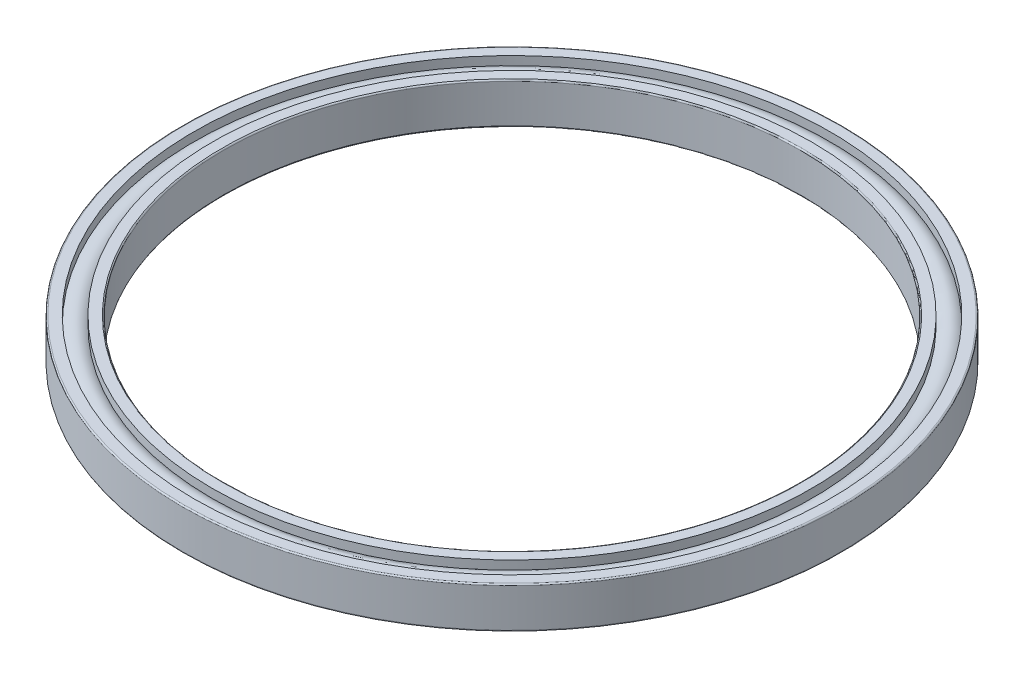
ISO-10303-21;
HEADER;
FILE_DESCRIPTION(('STEP AP214'),'2;1');
FILE_NAME('part.step','',(''),(''),'','','');
FILE_SCHEMA(('AUTOMOTIVE_DESIGN { 1 0 10303 214 1 1 1 1 }'));
ENDSEC;
DATA;
#1=APPLICATION_CONTEXT('core data for automotive mechanical design processes');
#2=APPLICATION_PROTOCOL_DEFINITION('international standard','automotive_design',2000,#1);
#3=PRODUCT_CONTEXT('',#1,'mechanical');
#4=PRODUCT('Part','Part','',(#3));
#5=PRODUCT_RELATED_PRODUCT_CATEGORY('part','',(#4));
#6=PRODUCT_DEFINITION_FORMATION('','',#4);
#7=PRODUCT_DEFINITION_CONTEXT('part definition',#1,'design');
#8=PRODUCT_DEFINITION('design','',#6,#7);
#9=PRODUCT_DEFINITION_SHAPE('','',#8);
#10=(LENGTH_UNIT() NAMED_UNIT(*) SI_UNIT(.MILLI.,.METRE.));
#11=(NAMED_UNIT(*) PLANE_ANGLE_UNIT() SI_UNIT($,.RADIAN.));
#12=(NAMED_UNIT(*) SI_UNIT($,.STERADIAN.) SOLID_ANGLE_UNIT());
#13=UNCERTAINTY_MEASURE_WITH_UNIT(LENGTH_MEASURE(1.E-05),#10,'distance_accuracy_value','');
#14=(GEOMETRIC_REPRESENTATION_CONTEXT(3) GLOBAL_UNCERTAINTY_ASSIGNED_CONTEXT((#13)) GLOBAL_UNIT_ASSIGNED_CONTEXT((#10,
#11,#12)) REPRESENTATION_CONTEXT('',''));
#15=CARTESIAN_POINT('',(0.,0.,0.));
#16=DIRECTION('',(0.,0.,1.));
#17=DIRECTION('',(1.,0.,0.));
#18=AXIS2_PLACEMENT_3D('',#15,#16,#17);
#19=CARTESIAN_POINT('',(0.,-4.0675,0.));
#20=DIRECTION('',(0.,1.,0.));
#21=DIRECTION('',(0.,0.,1.));
#22=AXIS2_PLACEMENT_3D('',#19,#20,#21);
#23=CYLINDRICAL_SURFACE('',#22,44.45);
#24=CARTESIAN_POINT('',(0.,2.4,0.));
#25=DIRECTION('',(0.,1.,0.));
#26=DIRECTION('',(0.,0.,-1.));
#27=AXIS2_PLACEMENT_3D('',#24,#25,#26);
#28=CIRCLE('',#27,44.45);
#29=CARTESIAN_POINT('',(0.,2.4,-44.45));
#30=VERTEX_POINT('',#29);
#31=EDGE_CURVE('E60',#30,#30,#28,.F.);
#32=ORIENTED_EDGE('',*,*,#31,.F.);
#33=EDGE_LOOP('',(#32));
#34=FACE_BOUND('',#33,.T.);
#35=CARTESIAN_POINT('',(0.,-3.55,0.));
#36=DIRECTION('',(0.,1.,0.));
#37=DIRECTION('',(0.,0.,-1.));
#38=AXIS2_PLACEMENT_3D('',#35,#36,#37);
#39=CIRCLE('',#38,44.45);
#40=CARTESIAN_POINT('',(0.,-3.55,-44.45));
#41=VERTEX_POINT('',#40);
#42=EDGE_CURVE('E283',#41,#41,#39,.T.);
#43=ORIENTED_EDGE('',*,*,#42,.F.);
#44=EDGE_LOOP('',(#43));
#45=FACE_BOUND('',#44,.T.);
#46=ADVANCED_FACE('F16',(#34,#45),#23,.F.);
#47=CARTESIAN_POINT('',(0.,-3.55,0.));
#48=DIRECTION('',(0.,1.,0.));
#49=DIRECTION('',(0.,0.,-1.));
#50=AXIS2_PLACEMENT_3D('',#47,#48,#49);
#51=TOROIDAL_SURFACE('',#50,44.65,0.2);
#52=CARTESIAN_POINT('',(0.,-3.75,0.));
#53=DIRECTION('',(0.,-1.,0.));
#54=DIRECTION('',(0.,0.,-1.));
#55=AXIS2_PLACEMENT_3D('',#52,#53,#54);
#56=CIRCLE('',#55,44.65);
#57=CARTESIAN_POINT('',(0.,-3.75,-44.65));
#58=VERTEX_POINT('',#57);
#59=CARTESIAN_POINT('',(0.,-3.75,44.65));
#60=VERTEX_POINT('',#59);
#61=EDGE_CURVE('E55',#58,#60,#56,.T.);
#62=ORIENTED_EDGE('',*,*,#61,.T.);
#63=CARTESIAN_POINT('',(0.,-3.75,0.));
#64=DIRECTION('',(0.,-1.,0.));
#65=DIRECTION('',(0.,0.,1.));
#66=AXIS2_PLACEMENT_3D('',#63,#64,#65);
#67=CIRCLE('',#66,44.65);
#68=EDGE_CURVE('E52',#60,#58,#67,.T.);
#69=ORIENTED_EDGE('',*,*,#68,.T.);
#70=EDGE_LOOP('',(#62,#69));
#71=FACE_BOUND('',#70,.T.);
#72=ORIENTED_EDGE('',*,*,#42,.T.);
#73=EDGE_LOOP('',(#72));
#74=FACE_BOUND('',#73,.T.);
#75=ADVANCED_FACE('F56',(#71,#74),#51,.T.);
#76=CARTESIAN_POINT('',(0.,2.4,0.));
#77=DIRECTION('',(0.,1.,0.));
#78=DIRECTION('',(0.,0.,-1.));
#79=AXIS2_PLACEMENT_3D('',#76,#77,#78);
#80=TOROIDAL_SURFACE('',#79,44.65,0.2);
#81=ORIENTED_EDGE('',*,*,#31,.T.);
#82=EDGE_LOOP('',(#81));
#83=FACE_BOUND('',#82,.T.);
#84=CARTESIAN_POINT('',(0.,2.6,0.));
#85=DIRECTION('',(0.,1.,0.));
#86=DIRECTION('',(0.,0.,-1.));
#87=AXIS2_PLACEMENT_3D('',#84,#85,#86);
#88=CIRCLE('',#87,44.65);
#89=CARTESIAN_POINT('',(0.,2.6,44.65));
#90=VERTEX_POINT('',#89);
#91=CARTESIAN_POINT('',(0.,2.6,-44.65));
#92=VERTEX_POINT('',#91);
#93=EDGE_CURVE('E249',#90,#92,#88,.F.);
#94=ORIENTED_EDGE('',*,*,#93,.F.);
#95=CARTESIAN_POINT('',(0.,2.6,0.));
#96=DIRECTION('',(0.,1.,0.));
#97=DIRECTION('',(0.,0.,1.));
#98=AXIS2_PLACEMENT_3D('',#95,#96,#97);
#99=CIRCLE('',#98,44.65);
#100=EDGE_CURVE('E65',#92,#90,#99,.F.);
#101=ORIENTED_EDGE('',*,*,#100,.F.);
#102=EDGE_LOOP('',(#94,#101));
#103=FACE_BOUND('',#102,.T.);
#104=ADVANCED_FACE('F86',(#83,#103),#80,.T.);
#105=CARTESIAN_POINT('',(0.,-3.75,0.));
#106=DIRECTION('',(0.,1.,0.));
#107=DIRECTION('',(0.,0.,1.));
#108=AXIS2_PLACEMENT_3D('',#105,#106,#107);
#109=PLANE('',#108);
#110=ORIENTED_EDGE('',*,*,#61,.F.);
#111=ORIENTED_EDGE('',*,*,#68,.F.);
#112=EDGE_LOOP('',(#110,#111));
#113=FACE_BOUND('',#112,.T.);
#114=CARTESIAN_POINT('',(0.,-3.75,0.));
#115=DIRECTION('',(0.,1.,0.));
#116=DIRECTION('',(0.,0.,1.));
#117=AXIS2_PLACEMENT_3D('',#114,#115,#116);
#118=CIRCLE('',#117,46.225);
#119=CARTESIAN_POINT('',(0.,-3.75,46.225));
#120=VERTEX_POINT('',#119);
#121=EDGE_CURVE('E258',#120,#120,#118,.T.);
#122=ORIENTED_EDGE('',*,*,#121,.F.);
#123=EDGE_LOOP('',(#122));
#124=FACE_BOUND('',#123,.T.);
#125=ADVANCED_FACE('F63',(#113,#124),#109,.F.);
#126=CARTESIAN_POINT('',(0.,2.6,0.));
#127=DIRECTION('',(0.,1.,0.));
#128=DIRECTION('',(0.,0.,1.));
#129=AXIS2_PLACEMENT_3D('',#126,#127,#128);
#130=PLANE('',#129);
#131=ORIENTED_EDGE('',*,*,#100,.T.);
#132=ORIENTED_EDGE('',*,*,#93,.T.);
#133=EDGE_LOOP('',(#131,#132));
#134=FACE_BOUND('',#133,.T.);
#135=CARTESIAN_POINT('',(0.,2.6,0.));
#136=DIRECTION('',(0.,1.,0.));
#137=DIRECTION('',(0.,0.,1.));
#138=AXIS2_PLACEMENT_3D('',#135,#136,#137);
#139=CIRCLE('',#138,46.225);
#140=CARTESIAN_POINT('',(0.,2.6,46.225));
#141=VERTEX_POINT('',#140);
#142=EDGE_CURVE('E237',#141,#141,#139,.F.);
#143=ORIENTED_EDGE('',*,*,#142,.F.);
#144=EDGE_LOOP('',(#143));
#145=FACE_BOUND('',#144,.T.);
#146=ADVANCED_FACE('F85',(#134,#145),#130,.T.);
#147=CARTESIAN_POINT('',(0.,-4.0675,0.));
#148=DIRECTION('',(0.,1.,0.));
#149=DIRECTION('',(0.,0.,1.));
#150=AXIS2_PLACEMENT_3D('',#147,#148,#149);
#151=CYLINDRICAL_SURFACE('',#150,46.225);
#152=ORIENTED_EDGE('',*,*,#121,.T.);
#153=EDGE_LOOP('',(#152));
#154=FACE_BOUND('',#153,.T.);
#155=CARTESIAN_POINT('',(0.,-2.39982875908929,0.));
#156=DIRECTION('',(0.,1.,0.));
#157=DIRECTION('',(0.,0.,-1.));
#158=AXIS2_PLACEMENT_3D('',#155,#156,#157);
#159=CIRCLE('',#158,46.2249999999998);
#160=CARTESIAN_POINT('',(0.,-2.39982875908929,-46.2249999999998));
#161=VERTEX_POINT('',#160);
#162=EDGE_CURVE('E234',#161,#161,#159,.T.);
#163=ORIENTED_EDGE('',*,*,#162,.F.);
#164=EDGE_LOOP('',(#163));
#165=FACE_BOUND('',#164,.T.);
#166=ADVANCED_FACE('F357',(#154,#165),#151,.T.);
#167=CARTESIAN_POINT('',(0.,-4.0675,0.));
#168=DIRECTION('',(0.,1.,0.));
#169=DIRECTION('',(0.,0.,1.));
#170=AXIS2_PLACEMENT_3D('',#167,#168,#169);
#171=CYLINDRICAL_SURFACE('',#170,46.225);
#172=CARTESIAN_POINT('',(0.,1.24982875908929,0.));
#173=DIRECTION('',(0.,1.,0.));
#174=DIRECTION('',(0.,0.,-1.));
#175=AXIS2_PLACEMENT_3D('',#172,#173,#174);
#176=CIRCLE('',#175,46.2249999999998);
#177=CARTESIAN_POINT('',(0.,1.24982875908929,-46.2249999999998));
#178=VERTEX_POINT('',#177);
#179=EDGE_CURVE('E231',#178,#178,#176,.F.);
#180=ORIENTED_EDGE('',*,*,#179,.F.);
#181=EDGE_LOOP('',(#180));
#182=FACE_BOUND('',#181,.T.);
#183=ORIENTED_EDGE('',*,*,#142,.T.);
#184=EDGE_LOOP('',(#183));
#185=FACE_BOUND('',#184,.T.);
#186=ADVANCED_FACE('F226',(#182,#185),#171,.T.);
#187=CARTESIAN_POINT('',(0.,-0.575,0.));
#188=DIRECTION('',(0.,1.,0.));
#189=DIRECTION('',(0.,0.,-1.));
#190=AXIS2_PLACEMENT_3D('',#187,#188,#189);
#191=TOROIDAL_SURFACE('',#190,47.625,2.3);
#192=ORIENTED_EDGE('',*,*,#162,.T.);
#193=EDGE_LOOP('',(#192));
#194=FACE_BOUND('',#193,.T.);
#195=CARTESIAN_POINT('',(0.,-2.399828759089,0.));
#196=DIRECTION('',(0.,1.,0.));
#197=DIRECTION('',(0.,0.,1.));
#198=AXIS2_PLACEMENT_3D('',#195,#196,#197);
#199=CIRCLE('',#198,49.025);
#200=CARTESIAN_POINT('',(0.,-2.399828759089,49.025));
#201=VERTEX_POINT('',#200);
#202=EDGE_CURVE('E230',#201,#201,#199,.F.);
#203=ORIENTED_EDGE('',*,*,#202,.T.);
#204=EDGE_LOOP('',(#203));
#205=FACE_BOUND('',#204,.T.);
#206=ADVANCED_FACE('F221',(#194,#205),#191,.T.);
#207=CARTESIAN_POINT('',(0.,-0.575,0.));
#208=DIRECTION('',(0.,1.,0.));
#209=DIRECTION('',(0.,0.,-1.));
#210=AXIS2_PLACEMENT_3D('',#207,#208,#209);
#211=TOROIDAL_SURFACE('',#210,47.625,2.3);
#212=CARTESIAN_POINT('',(0.,1.249828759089,0.));
#213=DIRECTION('',(0.,1.,0.));
#214=DIRECTION('',(0.,0.,1.));
#215=AXIS2_PLACEMENT_3D('',#212,#213,#214);
#216=CIRCLE('',#215,49.025);
#217=CARTESIAN_POINT('',(0.,1.249828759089,49.025));
#218=VERTEX_POINT('',#217);
#219=EDGE_CURVE('E214',#218,#218,#216,.T.);
#220=ORIENTED_EDGE('',*,*,#219,.T.);
#221=EDGE_LOOP('',(#220));
#222=FACE_BOUND('',#221,.T.);
#223=ORIENTED_EDGE('',*,*,#179,.T.);
#224=EDGE_LOOP('',(#223));
#225=FACE_BOUND('',#224,.T.);
#226=ADVANCED_FACE('F217',(#222,#225),#211,.T.);
#227=CARTESIAN_POINT('',(0.,-4.0675,0.));
#228=DIRECTION('',(0.,1.,0.));
#229=DIRECTION('',(0.,0.,1.));
#230=AXIS2_PLACEMENT_3D('',#227,#228,#229);
#231=CYLINDRICAL_SURFACE('',#230,49.025);
#232=ORIENTED_EDGE('',*,*,#202,.F.);
#233=EDGE_LOOP('',(#232));
#234=FACE_BOUND('',#233,.T.);
#235=CARTESIAN_POINT('',(0.,-3.75,0.));
#236=DIRECTION('',(0.,1.,0.));
#237=DIRECTION('',(0.,0.,1.));
#238=AXIS2_PLACEMENT_3D('',#235,#236,#237);
#239=CIRCLE('',#238,49.025);
#240=CARTESIAN_POINT('',(0.,-3.75,49.025));
#241=VERTEX_POINT('',#240);
#242=EDGE_CURVE('E277',#241,#241,#239,.F.);
#243=ORIENTED_EDGE('',*,*,#242,.T.);
#244=EDGE_LOOP('',(#243));
#245=FACE_BOUND('',#244,.T.);
#246=ADVANCED_FACE('F220',(#234,#245),#231,.F.);
#247=CARTESIAN_POINT('',(0.,-4.0675,0.));
#248=DIRECTION('',(0.,1.,0.));
#249=DIRECTION('',(0.,0.,1.));
#250=AXIS2_PLACEMENT_3D('',#247,#248,#249);
#251=CYLINDRICAL_SURFACE('',#250,49.025);
#252=CARTESIAN_POINT('',(0.,2.6,0.));
#253=DIRECTION('',(0.,1.,0.));
#254=DIRECTION('',(0.,0.,1.));
#255=AXIS2_PLACEMENT_3D('',#252,#253,#254);
#256=CIRCLE('',#255,49.025);
#257=CARTESIAN_POINT('',(0.,2.6,49.025));
#258=VERTEX_POINT('',#257);
#259=EDGE_CURVE('E275',#258,#258,#256,.F.);
#260=ORIENTED_EDGE('',*,*,#259,.F.);
#261=EDGE_LOOP('',(#260));
#262=FACE_BOUND('',#261,.T.);
#263=ORIENTED_EDGE('',*,*,#219,.F.);
#264=EDGE_LOOP('',(#263));
#265=FACE_BOUND('',#264,.T.);
#266=ADVANCED_FACE('F188',(#262,#265),#251,.F.);
#267=CARTESIAN_POINT('',(0.,-3.75,0.));
#268=DIRECTION('',(0.,1.,0.));
#269=DIRECTION('',(0.,0.,1.));
#270=AXIS2_PLACEMENT_3D('',#267,#268,#269);
#271=PLANE('',#270);
#272=ORIENTED_EDGE('',*,*,#242,.F.);
#273=EDGE_LOOP('',(#272));
#274=FACE_BOUND('',#273,.T.);
#275=CARTESIAN_POINT('',(0.,-3.75,0.));
#276=DIRECTION('',(0.,1.,0.));
#277=DIRECTION('',(0.,0.,-1.));
#278=AXIS2_PLACEMENT_3D('',#275,#276,#277);
#279=CIRCLE('',#278,50.6);
#280=CARTESIAN_POINT('',(0.,-3.75,-50.6));
#281=VERTEX_POINT('',#280);
#282=CARTESIAN_POINT('',(0.,-3.75,50.6));
#283=VERTEX_POINT('',#282);
#284=EDGE_CURVE('E173',#281,#283,#279,.T.);
#285=ORIENTED_EDGE('',*,*,#284,.F.);
#286=CARTESIAN_POINT('',(0.,-3.75,0.));
#287=DIRECTION('',(0.,1.,0.));
#288=DIRECTION('',(0.,0.,1.));
#289=AXIS2_PLACEMENT_3D('',#286,#287,#288);
#290=CIRCLE('',#289,50.6);
#291=EDGE_CURVE('E201',#283,#281,#290,.T.);
#292=ORIENTED_EDGE('',*,*,#291,.F.);
#293=EDGE_LOOP('',(#285,#292));
#294=FACE_BOUND('',#293,.T.);
#295=ADVANCED_FACE('F179',(#274,#294),#271,.F.);
#296=CARTESIAN_POINT('',(0.,2.6,0.));
#297=DIRECTION('',(0.,1.,0.));
#298=DIRECTION('',(0.,0.,1.));
#299=AXIS2_PLACEMENT_3D('',#296,#297,#298);
#300=PLANE('',#299);
#301=ORIENTED_EDGE('',*,*,#259,.T.);
#302=EDGE_LOOP('',(#301));
#303=FACE_BOUND('',#302,.T.);
#304=CARTESIAN_POINT('',(0.,2.6,0.));
#305=DIRECTION('',(0.,-1.,0.));
#306=DIRECTION('',(0.,0.,1.));
#307=AXIS2_PLACEMENT_3D('',#304,#305,#306);
#308=CIRCLE('',#307,50.6);
#309=CARTESIAN_POINT('',(0.,2.6,50.6));
#310=VERTEX_POINT('',#309);
#311=CARTESIAN_POINT('',(0.,2.6,-50.6));
#312=VERTEX_POINT('',#311);
#313=EDGE_CURVE('E34',#310,#312,#308,.T.);
#314=ORIENTED_EDGE('',*,*,#313,.F.);
#315=CARTESIAN_POINT('',(0.,2.6,0.));
#316=DIRECTION('',(0.,-1.,0.));
#317=DIRECTION('',(0.,0.,-1.));
#318=AXIS2_PLACEMENT_3D('',#315,#316,#317);
#319=CIRCLE('',#318,50.6);
#320=EDGE_CURVE('E150',#312,#310,#319,.T.);
#321=ORIENTED_EDGE('',*,*,#320,.F.);
#322=EDGE_LOOP('',(#314,#321));
#323=FACE_BOUND('',#322,.T.);
#324=ADVANCED_FACE('F129',(#303,#323),#300,.T.);
#325=CARTESIAN_POINT('',(0.,-3.55,0.));
#326=DIRECTION('',(0.,1.,0.));
#327=DIRECTION('',(0.,0.,-1.));
#328=AXIS2_PLACEMENT_3D('',#325,#326,#327);
#329=TOROIDAL_SURFACE('',#328,50.6,0.2);
#330=CARTESIAN_POINT('',(0.,-3.55,0.));
#331=DIRECTION('',(0.,1.,0.));
#332=DIRECTION('',(0.,0.,1.));
#333=AXIS2_PLACEMENT_3D('',#330,#331,#332);
#334=CIRCLE('',#333,50.8);
#335=CARTESIAN_POINT('',(0.,-3.55,50.8));
#336=VERTEX_POINT('',#335);
#337=EDGE_CURVE('E26',#336,#336,#334,.T.);
#338=ORIENTED_EDGE('',*,*,#337,.F.);
#339=EDGE_LOOP('',(#338));
#340=FACE_BOUND('',#339,.T.);
#341=ORIENTED_EDGE('',*,*,#291,.T.);
#342=ORIENTED_EDGE('',*,*,#284,.T.);
#343=EDGE_LOOP('',(#341,#342));
#344=FACE_BOUND('',#343,.T.);
#345=ADVANCED_FACE('F117',(#340,#344),#329,.T.);
#346=CARTESIAN_POINT('',(0.,2.4,0.));
#347=DIRECTION('',(0.,1.,0.));
#348=DIRECTION('',(0.,0.,-1.));
#349=AXIS2_PLACEMENT_3D('',#346,#347,#348);
#350=TOROIDAL_SURFACE('',#349,50.6,0.2);
#351=ORIENTED_EDGE('',*,*,#313,.T.);
#352=ORIENTED_EDGE('',*,*,#320,.T.);
#353=EDGE_LOOP('',(#351,#352));
#354=FACE_BOUND('',#353,.T.);
#355=CARTESIAN_POINT('',(0.,2.4,0.));
#356=DIRECTION('',(0.,1.,0.));
#357=DIRECTION('',(0.,0.,1.));
#358=AXIS2_PLACEMENT_3D('',#355,#356,#357);
#359=CIRCLE('',#358,50.8);
#360=CARTESIAN_POINT('',(0.,2.4,50.8));
#361=VERTEX_POINT('',#360);
#362=EDGE_CURVE('E11',#361,#361,#359,.F.);
#363=ORIENTED_EDGE('',*,*,#362,.F.);
#364=EDGE_LOOP('',(#363));
#365=FACE_BOUND('',#364,.T.);
#366=ADVANCED_FACE('F128',(#354,#365),#350,.T.);
#367=CARTESIAN_POINT('',(0.,-4.0675,0.));
#368=DIRECTION('',(0.,1.,0.));
#369=DIRECTION('',(0.,0.,1.));
#370=AXIS2_PLACEMENT_3D('',#367,#368,#369);
#371=CYLINDRICAL_SURFACE('',#370,50.8);
#372=ORIENTED_EDGE('',*,*,#362,.T.);
#373=EDGE_LOOP('',(#372));
#374=FACE_BOUND('',#373,.T.);
#375=ORIENTED_EDGE('',*,*,#337,.T.);
#376=EDGE_LOOP('',(#375));
#377=FACE_BOUND('',#376,.T.);
#378=ADVANCED_FACE('F305',(#374,#377),#371,.T.);
#379=CLOSED_SHELL('',(#46,#75,#104,#125,#146,#166,#186,#206,#226,#246,#266,#295,#324,#345,#366,#378));
#380=MANIFOLD_SOLID_BREP('B1',#379);
#381=ADVANCED_BREP_SHAPE_REPRESENTATION('',(#18,#380),#14);
#382=SHAPE_DEFINITION_REPRESENTATION(#9,#381);
ENDSEC;
END-ISO-10303-21;
